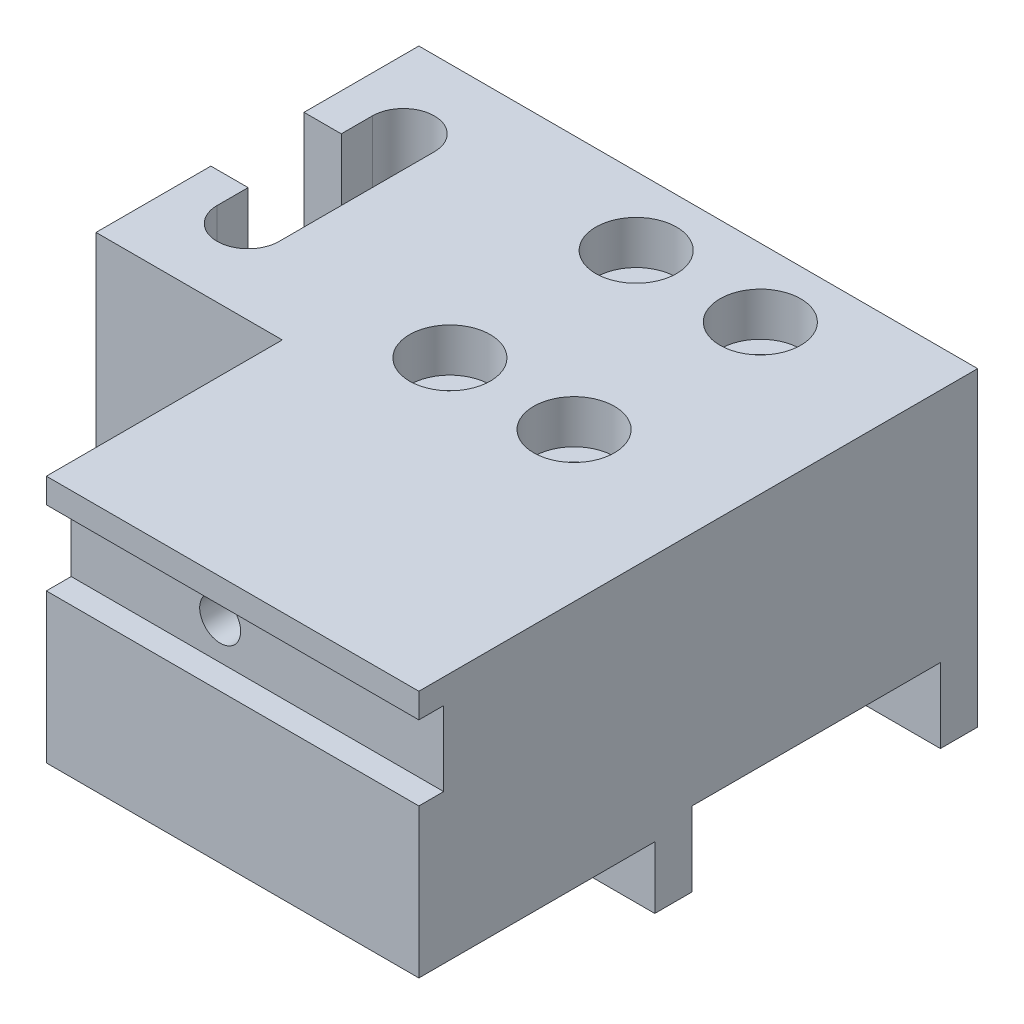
ISO-10303-21;
HEADER;
FILE_DESCRIPTION(('STEP AP214'),'2;1');
FILE_NAME('part.step','',(''),(''),'','','');
FILE_SCHEMA(('AUTOMOTIVE_DESIGN { 1 0 10303 214 1 1 1 1 }'));
ENDSEC;
DATA;
#1=APPLICATION_CONTEXT('core data for automotive mechanical design processes');
#2=APPLICATION_PROTOCOL_DEFINITION('international standard','automotive_design',2000,#1);
#3=PRODUCT_CONTEXT('',#1,'mechanical');
#4=PRODUCT('Part','Part','',(#3));
#5=PRODUCT_RELATED_PRODUCT_CATEGORY('part','',(#4));
#6=PRODUCT_DEFINITION_FORMATION('','',#4);
#7=PRODUCT_DEFINITION_CONTEXT('part definition',#1,'design');
#8=PRODUCT_DEFINITION('design','',#6,#7);
#9=PRODUCT_DEFINITION_SHAPE('','',#8);
#10=(LENGTH_UNIT() NAMED_UNIT(*) SI_UNIT(.MILLI.,.METRE.));
#11=(NAMED_UNIT(*) PLANE_ANGLE_UNIT() SI_UNIT($,.RADIAN.));
#12=(NAMED_UNIT(*) SI_UNIT($,.STERADIAN.) SOLID_ANGLE_UNIT());
#13=UNCERTAINTY_MEASURE_WITH_UNIT(LENGTH_MEASURE(1.E-05),#10,'distance_accuracy_value','');
#14=(GEOMETRIC_REPRESENTATION_CONTEXT(3) GLOBAL_UNCERTAINTY_ASSIGNED_CONTEXT((#13)) GLOBAL_UNIT_ASSIGNED_CONTEXT((#10,
#11,#12)) REPRESENTATION_CONTEXT('',''));
#15=CARTESIAN_POINT('',(0.,0.,0.));
#16=DIRECTION('',(0.,0.,1.));
#17=DIRECTION('',(1.,0.,0.));
#18=AXIS2_PLACEMENT_3D('',#15,#16,#17);
#19=CARTESIAN_POINT('',(23.,0.,20.5));
#20=DIRECTION('',(0.,1.,0.));
#21=DIRECTION('',(0.,0.,1.));
#22=AXIS2_PLACEMENT_3D('',#19,#20,#21);
#23=CYLINDRICAL_SURFACE('',#22,1.75);
#24=CARTESIAN_POINT('',(23.,6.00000000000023,20.5));
#25=DIRECTION('',(0.,1.,0.));
#26=DIRECTION('',(0.,0.,1.));
#27=AXIS2_PLACEMENT_3D('',#24,#25,#26);
#28=CIRCLE('',#27,1.75);
#29=CARTESIAN_POINT('',(23.,6.00000000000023,22.25));
#30=VERTEX_POINT('',#29);
#31=EDGE_CURVE('E260',#30,#30,#28,.T.);
#32=ORIENTED_EDGE('',*,*,#31,.F.);
#33=EDGE_LOOP('',(#32));
#34=FACE_BOUND('',#33,.T.);
#35=CARTESIAN_POINT('',(23.,21.5000000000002,20.5));
#36=DIRECTION('',(0.,1.,0.));
#37=DIRECTION('',(0.,0.,1.));
#38=AXIS2_PLACEMENT_3D('',#35,#36,#37);
#39=CIRCLE('',#38,1.75);
#40=CARTESIAN_POINT('',(23.,21.5000000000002,22.25));
#41=VERTEX_POINT('',#40);
#42=EDGE_CURVE('E38',#41,#41,#39,.F.);
#43=ORIENTED_EDGE('',*,*,#42,.F.);
#44=EDGE_LOOP('',(#43));
#45=FACE_BOUND('',#44,.T.);
#46=ADVANCED_FACE('F34',(#34,#45),#23,.F.);
#47=CARTESIAN_POINT('',(33.,0.,20.5));
#48=DIRECTION('',(0.,1.,0.));
#49=DIRECTION('',(0.,0.,1.));
#50=AXIS2_PLACEMENT_3D('',#47,#48,#49);
#51=CYLINDRICAL_SURFACE('',#50,1.75);
#52=CARTESIAN_POINT('',(33.,6.00000000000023,20.5));
#53=DIRECTION('',(0.,1.,0.));
#54=DIRECTION('',(0.,0.,1.));
#55=AXIS2_PLACEMENT_3D('',#52,#53,#54);
#56=CIRCLE('',#55,1.75);
#57=CARTESIAN_POINT('',(33.,6.00000000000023,22.25));
#58=VERTEX_POINT('',#57);
#59=EDGE_CURVE('E257',#58,#58,#56,.T.);
#60=ORIENTED_EDGE('',*,*,#59,.F.);
#61=EDGE_LOOP('',(#60));
#62=FACE_BOUND('',#61,.T.);
#63=CARTESIAN_POINT('',(33.,21.5000000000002,20.5));
#64=DIRECTION('',(0.,1.,0.));
#65=DIRECTION('',(0.,0.,1.));
#66=AXIS2_PLACEMENT_3D('',#63,#64,#65);
#67=CIRCLE('',#66,1.75);
#68=CARTESIAN_POINT('',(33.,21.5000000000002,22.25));
#69=VERTEX_POINT('',#68);
#70=EDGE_CURVE('E283',#69,#69,#67,.F.);
#71=ORIENTED_EDGE('',*,*,#70,.F.);
#72=EDGE_LOOP('',(#71));
#73=FACE_BOUND('',#72,.T.);
#74=ADVANCED_FACE('F547',(#62,#73),#51,.F.);
#75=CARTESIAN_POINT('',(33.,0.,5.5));
#76=DIRECTION('',(0.,1.,0.));
#77=DIRECTION('',(0.,0.,1.));
#78=AXIS2_PLACEMENT_3D('',#75,#76,#77);
#79=CYLINDRICAL_SURFACE('',#78,1.75);
#80=CARTESIAN_POINT('',(33.,6.00000000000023,5.5));
#81=DIRECTION('',(0.,1.,0.));
#82=DIRECTION('',(0.,0.,1.));
#83=AXIS2_PLACEMENT_3D('',#80,#81,#82);
#84=CIRCLE('',#83,1.75);
#85=CARTESIAN_POINT('',(33.,6.00000000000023,7.25));
#86=VERTEX_POINT('',#85);
#87=EDGE_CURVE('E254',#86,#86,#84,.T.);
#88=ORIENTED_EDGE('',*,*,#87,.F.);
#89=EDGE_LOOP('',(#88));
#90=FACE_BOUND('',#89,.T.);
#91=CARTESIAN_POINT('',(33.,21.5000000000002,5.5));
#92=DIRECTION('',(0.,1.,0.));
#93=DIRECTION('',(0.,0.,1.));
#94=AXIS2_PLACEMENT_3D('',#91,#92,#93);
#95=CIRCLE('',#94,1.75);
#96=CARTESIAN_POINT('',(33.,21.5000000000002,7.25));
#97=VERTEX_POINT('',#96);
#98=EDGE_CURVE('E279',#97,#97,#95,.F.);
#99=ORIENTED_EDGE('',*,*,#98,.F.);
#100=EDGE_LOOP('',(#99));
#101=FACE_BOUND('',#100,.T.);
#102=ADVANCED_FACE('F553',(#90,#101),#79,.F.);
#103=CARTESIAN_POINT('',(23.,0.,5.5));
#104=DIRECTION('',(0.,1.,0.));
#105=DIRECTION('',(0.,0.,1.));
#106=AXIS2_PLACEMENT_3D('',#103,#104,#105);
#107=CYLINDRICAL_SURFACE('',#106,1.75);
#108=CARTESIAN_POINT('',(23.,6.00000000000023,5.5));
#109=DIRECTION('',(0.,1.,0.));
#110=DIRECTION('',(0.,0.,1.));
#111=AXIS2_PLACEMENT_3D('',#108,#109,#110);
#112=CIRCLE('',#111,1.75);
#113=CARTESIAN_POINT('',(23.,6.00000000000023,7.25));
#114=VERTEX_POINT('',#113);
#115=EDGE_CURVE('E250',#114,#114,#112,.T.);
#116=ORIENTED_EDGE('',*,*,#115,.F.);
#117=EDGE_LOOP('',(#116));
#118=FACE_BOUND('',#117,.T.);
#119=CARTESIAN_POINT('',(23.,21.5000000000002,5.5));
#120=DIRECTION('',(0.,1.,0.));
#121=DIRECTION('',(0.,0.,1.));
#122=AXIS2_PLACEMENT_3D('',#119,#120,#121);
#123=CIRCLE('',#122,1.75);
#124=CARTESIAN_POINT('',(23.,21.5000000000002,7.25));
#125=VERTEX_POINT('',#124);
#126=EDGE_CURVE('E209',#125,#125,#123,.F.);
#127=ORIENTED_EDGE('',*,*,#126,.F.);
#128=EDGE_LOOP('',(#127));
#129=FACE_BOUND('',#128,.T.);
#130=ADVANCED_FACE('F563',(#118,#129),#107,.F.);
#131=CARTESIAN_POINT('',(0.,6.00000000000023,45.));
#132=DIRECTION('',(1.,0.,0.));
#133=DIRECTION('',(0.,0.,-1.));
#134=AXIS2_PLACEMENT_3D('',#131,#132,#133);
#135=PLANE('',#134);
#136=DIRECTION('',(0.,1.,0.));
#137=VECTOR('',#136,1.);
#138=CARTESIAN_POINT('',(0.,0.,26.));
#139=LINE('',#138,#137);
#140=CARTESIAN_POINT('',(0.,6.00000000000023,26.));
#141=VERTEX_POINT('',#140);
#142=CARTESIAN_POINT('',(0.,25.0000000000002,26.));
#143=VERTEX_POINT('',#142);
#144=EDGE_CURVE('E333',#141,#143,#139,.T.);
#145=ORIENTED_EDGE('',*,*,#144,.T.);
#146=DIRECTION('',(0.,0.,-1.));
#147=VECTOR('',#146,1.);
#148=CARTESIAN_POINT('',(0.,25.0000000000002,45.));
#149=LINE('',#148,#147);
#150=CARTESIAN_POINT('',(0.,25.0000000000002,16.75));
#151=VERTEX_POINT('',#150);
#152=EDGE_CURVE('E226',#143,#151,#149,.T.);
#153=ORIENTED_EDGE('',*,*,#152,.T.);
#154=DIRECTION('',(0.,1.,0.));
#155=VECTOR('',#154,1.);
#156=CARTESIAN_POINT('',(0.,0.,16.75));
#157=LINE('',#156,#155);
#158=CARTESIAN_POINT('',(0.,6.00000000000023,16.75));
#159=VERTEX_POINT('',#158);
#160=EDGE_CURVE('E336',#159,#151,#157,.T.);
#161=ORIENTED_EDGE('',*,*,#160,.F.);
#162=DIRECTION('',(0.,0.,-1.));
#163=VECTOR('',#162,1.);
#164=CARTESIAN_POINT('',(0.,6.00000000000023,45.));
#165=LINE('',#164,#163);
#166=EDGE_CURVE('E227',#141,#159,#165,.T.);
#167=ORIENTED_EDGE('',*,*,#166,.F.);
#168=EDGE_LOOP('',(#145,#153,#161,#167));
#169=FACE_BOUND('',#168,.T.);
#170=ADVANCED_FACE('F493',(#169),#135,.F.);
#171=DIRECTION('',(0.,1.,0.));
#172=VECTOR('',#171,1.);
#173=CARTESIAN_POINT('',(0.,0.,9.25));
#174=LINE('',#173,#172);
#175=CARTESIAN_POINT('',(0.,6.00000000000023,9.25000000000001));
#176=VERTEX_POINT('',#175);
#177=CARTESIAN_POINT('',(0.,25.0000000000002,9.25));
#178=VERTEX_POINT('',#177);
#179=EDGE_CURVE('E51',#176,#178,#174,.T.);
#180=ORIENTED_EDGE('',*,*,#179,.T.);
#181=CARTESIAN_POINT('',(0.,25.0000000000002,0.));
#182=VERTEX_POINT('',#181);
#183=EDGE_CURVE('E215',#178,#182,#149,.T.);
#184=ORIENTED_EDGE('',*,*,#183,.T.);
#185=DIRECTION('',(0.,-1.,0.));
#186=VECTOR('',#185,1.);
#187=CARTESIAN_POINT('',(0.,6.00000000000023,0.));
#188=LINE('',#187,#186);
#189=CARTESIAN_POINT('',(0.,6.00000000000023,0.));
#190=VERTEX_POINT('',#189);
#191=EDGE_CURVE('E422',#182,#190,#188,.T.);
#192=ORIENTED_EDGE('',*,*,#191,.T.);
#193=EDGE_CURVE('E217',#176,#190,#165,.T.);
#194=ORIENTED_EDGE('',*,*,#193,.F.);
#195=EDGE_LOOP('',(#180,#184,#192,#194));
#196=FACE_BOUND('',#195,.T.);
#197=ADVANCED_FACE('F213',(#196),#135,.F.);
#198=CARTESIAN_POINT('',(45.,2.27373675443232E-13,45.));
#199=DIRECTION('',(0.,0.,1.));
#200=DIRECTION('',(1.,0.,0.));
#201=AXIS2_PLACEMENT_3D('',#198,#199,#200);
#202=PLANE('',#201);
#203=DIRECTION('',(1.,0.,0.));
#204=VECTOR('',#203,1.);
#205=CARTESIAN_POINT('',(0.,17.,45.));
#206=LINE('',#205,#204);
#207=CARTESIAN_POINT('',(15.,17.,45.));
#208=VERTEX_POINT('',#207);
#209=CARTESIAN_POINT('',(45.,17.,45.));
#210=VERTEX_POINT('',#209);
#211=EDGE_CURVE('E397',#208,#210,#206,.T.);
#212=ORIENTED_EDGE('',*,*,#211,.F.);
#213=DIRECTION('',(0.,-1.,0.));
#214=VECTOR('',#213,1.);
#215=CARTESIAN_POINT('',(15.,2.27373675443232E-13,45.));
#216=LINE('',#215,#214);
#217=CARTESIAN_POINT('',(15.,5.,45.));
#218=VERTEX_POINT('',#217);
#219=EDGE_CURVE('E413',#208,#218,#216,.T.);
#220=ORIENTED_EDGE('',*,*,#219,.T.);
#221=DIRECTION('',(1.,0.,0.));
#222=VECTOR('',#221,1.);
#223=CARTESIAN_POINT('',(45.,5.,45.));
#224=LINE('',#223,#222);
#225=CARTESIAN_POINT('',(45.,5.,45.));
#226=VERTEX_POINT('',#225);
#227=EDGE_CURVE('E239',#218,#226,#224,.T.);
#228=ORIENTED_EDGE('',*,*,#227,.T.);
#229=DIRECTION('',(0.,1.,0.));
#230=VECTOR('',#229,1.);
#231=CARTESIAN_POINT('',(45.,2.27373675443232E-13,45.));
#232=LINE('',#231,#230);
#233=EDGE_CURVE('E408',#226,#210,#232,.T.);
#234=ORIENTED_EDGE('',*,*,#233,.T.);
#235=EDGE_LOOP('',(#212,#220,#228,#234));
#236=FACE_BOUND('',#235,.T.);
#237=ADVANCED_FACE('F467',(#236),#202,.T.);
#238=DIRECTION('',(-1.,0.,0.));
#239=VECTOR('',#238,1.);
#240=CARTESIAN_POINT('',(0.,25.0000000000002,45.));
#241=LINE('',#240,#239);
#242=CARTESIAN_POINT('',(45.,25.0000000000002,45.));
#243=VERTEX_POINT('',#242);
#244=CARTESIAN_POINT('',(15.,25.0000000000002,45.));
#245=VERTEX_POINT('',#244);
#246=EDGE_CURVE('E410',#243,#245,#241,.T.);
#247=ORIENTED_EDGE('',*,*,#246,.T.);
#248=DIRECTION('',(0.,1.,0.));
#249=VECTOR('',#248,1.);
#250=CARTESIAN_POINT('',(15.,0.,45.));
#251=LINE('',#250,#249);
#252=CARTESIAN_POINT('',(15.,23.,45.));
#253=VERTEX_POINT('',#252);
#254=EDGE_CURVE('E328',#253,#245,#251,.T.);
#255=ORIENTED_EDGE('',*,*,#254,.F.);
#256=DIRECTION('',(1.,0.,0.));
#257=VECTOR('',#256,1.);
#258=CARTESIAN_POINT('',(0.,23.,45.));
#259=LINE('',#258,#257);
#260=CARTESIAN_POINT('',(45.,23.,45.));
#261=VERTEX_POINT('',#260);
#262=EDGE_CURVE('E382',#253,#261,#259,.T.);
#263=ORIENTED_EDGE('',*,*,#262,.T.);
#264=EDGE_CURVE('E406',#261,#243,#232,.T.);
#265=ORIENTED_EDGE('',*,*,#264,.T.);
#266=EDGE_LOOP('',(#247,#255,#263,#265));
#267=FACE_BOUND('',#266,.T.);
#268=ADVANCED_FACE('F484',(#267),#202,.T.);
#269=CARTESIAN_POINT('',(0.,25.0000000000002,45.));
#270=DIRECTION('',(0.,-1.,0.));
#271=DIRECTION('',(0.,0.,-1.));
#272=AXIS2_PLACEMENT_3D('',#269,#270,#271);
#273=PLANE('',#272);
#274=CARTESIAN_POINT('',(23.,25.0000000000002,20.5));
#275=DIRECTION('',(0.,1.,0.));
#276=DIRECTION('',(0.,0.,1.));
#277=AXIS2_PLACEMENT_3D('',#274,#275,#276);
#278=CIRCLE('',#277,3.25);
#279=CARTESIAN_POINT('',(23.,25.0000000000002,23.75));
#280=VERTEX_POINT('',#279);
#281=EDGE_CURVE('E299',#280,#280,#278,.T.);
#282=ORIENTED_EDGE('',*,*,#281,.F.);
#283=EDGE_LOOP('',(#282));
#284=FACE_BOUND('',#283,.T.);
#285=CARTESIAN_POINT('',(33.,25.0000000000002,20.5));
#286=DIRECTION('',(0.,1.,0.));
#287=DIRECTION('',(0.,0.,1.));
#288=AXIS2_PLACEMENT_3D('',#285,#286,#287);
#289=CIRCLE('',#288,3.25);
#290=CARTESIAN_POINT('',(33.,25.0000000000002,23.75));
#291=VERTEX_POINT('',#290);
#292=EDGE_CURVE('E292',#291,#291,#289,.T.);
#293=ORIENTED_EDGE('',*,*,#292,.F.);
#294=EDGE_LOOP('',(#293));
#295=FACE_BOUND('',#294,.T.);
#296=CARTESIAN_POINT('',(33.,25.0000000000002,5.5));
#297=DIRECTION('',(0.,1.,0.));
#298=DIRECTION('',(0.,0.,1.));
#299=AXIS2_PLACEMENT_3D('',#296,#297,#298);
#300=CIRCLE('',#299,3.25);
#301=CARTESIAN_POINT('',(33.,25.0000000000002,8.75));
#302=VERTEX_POINT('',#301);
#303=EDGE_CURVE('E285',#302,#302,#300,.T.);
#304=ORIENTED_EDGE('',*,*,#303,.F.);
#305=EDGE_LOOP('',(#304));
#306=FACE_BOUND('',#305,.T.);
#307=CARTESIAN_POINT('',(23.,25.0000000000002,5.5));
#308=DIRECTION('',(0.,1.,0.));
#309=DIRECTION('',(0.,0.,1.));
#310=AXIS2_PLACEMENT_3D('',#307,#308,#309);
#311=CIRCLE('',#310,3.25);
#312=CARTESIAN_POINT('',(23.,25.0000000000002,8.75));
#313=VERTEX_POINT('',#312);
#314=EDGE_CURVE('E281',#313,#313,#311,.T.);
#315=ORIENTED_EDGE('',*,*,#314,.F.);
#316=EDGE_LOOP('',(#315));
#317=FACE_BOUND('',#316,.T.);
#318=DIRECTION('',(0.,0.,1.));
#319=VECTOR('',#318,1.);
#320=CARTESIAN_POINT('',(15.,25.0000000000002,45.));
#321=LINE('',#320,#319);
#322=CARTESIAN_POINT('',(15.,25.0000000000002,26.));
#323=VERTEX_POINT('',#322);
#324=EDGE_CURVE('E218',#323,#245,#321,.T.);
#325=ORIENTED_EDGE('',*,*,#324,.T.);
#326=ORIENTED_EDGE('',*,*,#246,.F.);
#327=DIRECTION('',(0.,0.,-1.));
#328=VECTOR('',#327,1.);
#329=CARTESIAN_POINT('',(45.,25.0000000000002,45.));
#330=LINE('',#329,#328);
#331=CARTESIAN_POINT('',(45.,25.0000000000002,0.));
#332=VERTEX_POINT('',#331);
#333=EDGE_CURVE('E230',#243,#332,#330,.T.);
#334=ORIENTED_EDGE('',*,*,#333,.T.);
#335=DIRECTION('',(-1.,0.,0.));
#336=VECTOR('',#335,1.);
#337=CARTESIAN_POINT('',(0.,25.0000000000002,0.));
#338=LINE('',#337,#336);
#339=EDGE_CURVE('E224',#332,#182,#338,.T.);
#340=ORIENTED_EDGE('',*,*,#339,.T.);
#341=ORIENTED_EDGE('',*,*,#183,.F.);
#342=DIRECTION('',(1.,0.,0.));
#343=VECTOR('',#342,1.);
#344=CARTESIAN_POINT('',(0.,25.0000000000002,9.25));
#345=LINE('',#344,#343);
#346=CARTESIAN_POINT('',(3.,25.0000000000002,9.25));
#347=VERTEX_POINT('',#346);
#348=EDGE_CURVE('E200',#178,#347,#345,.T.);
#349=ORIENTED_EDGE('',*,*,#348,.T.);
#350=DIRECTION('',(0.,0.,-1.));
#351=VECTOR('',#350,1.);
#352=CARTESIAN_POINT('',(3.,25.0000000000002,9.25));
#353=LINE('',#352,#351);
#354=CARTESIAN_POINT('',(3.,25.0000000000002,6.75));
#355=VERTEX_POINT('',#354);
#356=EDGE_CURVE('E208',#347,#355,#353,.T.);
#357=ORIENTED_EDGE('',*,*,#356,.T.);
#358=CARTESIAN_POINT('',(5.5,25.0000000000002,6.75));
#359=DIRECTION('',(0.,-1.,0.));
#360=DIRECTION('',(0.,0.,1.));
#361=AXIS2_PLACEMENT_3D('',#358,#359,#360);
#362=CIRCLE('',#361,2.5);
#363=CARTESIAN_POINT('',(8.,25.0000000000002,6.75));
#364=VERTEX_POINT('',#363);
#365=EDGE_CURVE('E309',#355,#364,#362,.T.);
#366=ORIENTED_EDGE('',*,*,#365,.T.);
#367=DIRECTION('',(0.,0.,1.));
#368=VECTOR('',#367,1.);
#369=CARTESIAN_POINT('',(8.,25.0000000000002,19.25));
#370=LINE('',#369,#368);
#371=CARTESIAN_POINT('',(8.,25.0000000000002,19.25));
#372=VERTEX_POINT('',#371);
#373=EDGE_CURVE('E312',#364,#372,#370,.T.);
#374=ORIENTED_EDGE('',*,*,#373,.T.);
#375=CARTESIAN_POINT('',(5.5,25.0000000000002,19.25));
#376=DIRECTION('',(0.,-1.,0.));
#377=DIRECTION('',(0.,0.,1.));
#378=AXIS2_PLACEMENT_3D('',#375,#376,#377);
#379=CIRCLE('',#378,2.5);
#380=CARTESIAN_POINT('',(3.,25.0000000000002,19.25));
#381=VERTEX_POINT('',#380);
#382=EDGE_CURVE('E315',#372,#381,#379,.T.);
#383=ORIENTED_EDGE('',*,*,#382,.T.);
#384=DIRECTION('',(0.,0.,-1.));
#385=VECTOR('',#384,1.);
#386=CARTESIAN_POINT('',(3.,25.0000000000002,19.25));
#387=LINE('',#386,#385);
#388=CARTESIAN_POINT('',(3.,25.0000000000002,16.75));
#389=VERTEX_POINT('',#388);
#390=EDGE_CURVE('E318',#381,#389,#387,.T.);
#391=ORIENTED_EDGE('',*,*,#390,.T.);
#392=DIRECTION('',(-1.,0.,0.));
#393=VECTOR('',#392,1.);
#394=CARTESIAN_POINT('',(0.,25.0000000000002,16.75));
#395=LINE('',#394,#393);
#396=EDGE_CURVE('E321',#389,#151,#395,.T.);
#397=ORIENTED_EDGE('',*,*,#396,.T.);
#398=ORIENTED_EDGE('',*,*,#152,.F.);
#399=DIRECTION('',(1.,0.,0.));
#400=VECTOR('',#399,1.);
#401=CARTESIAN_POINT('',(0.,25.0000000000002,26.));
#402=LINE('',#401,#400);
#403=EDGE_CURVE('E324',#143,#323,#402,.T.);
#404=ORIENTED_EDGE('',*,*,#403,.T.);
#405=EDGE_LOOP('',(#325,#326,#334,#340,#341,#349,#357,#366,#374,#383,#391,#397,#398,#404));
#406=FACE_BOUND('',#405,.T.);
#407=ADVANCED_FACE('F221',(#284,#295,#306,#317,#406),#273,.F.);
#408=CARTESIAN_POINT('',(15.,6.00000000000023,45.));
#409=DIRECTION('',(0.,1.,0.));
#410=DIRECTION('',(0.,0.,1.));
#411=AXIS2_PLACEMENT_3D('',#408,#409,#410);
#412=PLANE('',#411);
#413=ORIENTED_EDGE('',*,*,#31,.T.);
#414=EDGE_LOOP('',(#413));
#415=FACE_BOUND('',#414,.T.);
#416=ORIENTED_EDGE('',*,*,#59,.T.);
#417=EDGE_LOOP('',(#416));
#418=FACE_BOUND('',#417,.T.);
#419=ORIENTED_EDGE('',*,*,#87,.T.);
#420=EDGE_LOOP('',(#419));
#421=FACE_BOUND('',#420,.T.);
#422=ORIENTED_EDGE('',*,*,#115,.T.);
#423=EDGE_LOOP('',(#422));
#424=FACE_BOUND('',#423,.T.);
#425=DIRECTION('',(1.,0.,0.));
#426=VECTOR('',#425,1.);
#427=CARTESIAN_POINT('',(15.,6.00000000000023,26.));
#428=LINE('',#427,#426);
#429=CARTESIAN_POINT('',(15.,6.00000000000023,26.));
#430=VERTEX_POINT('',#429);
#431=EDGE_CURVE('E12',#141,#430,#428,.T.);
#432=ORIENTED_EDGE('',*,*,#431,.F.);
#433=ORIENTED_EDGE('',*,*,#166,.T.);
#434=DIRECTION('',(-1.,0.,0.));
#435=VECTOR('',#434,1.);
#436=CARTESIAN_POINT('',(15.,6.00000000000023,16.75));
#437=LINE('',#436,#435);
#438=CARTESIAN_POINT('',(3.,6.00000000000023,16.75));
#439=VERTEX_POINT('',#438);
#440=EDGE_CURVE('E43',#439,#159,#437,.T.);
#441=ORIENTED_EDGE('',*,*,#440,.F.);
#442=DIRECTION('',(0.,0.,-1.));
#443=VECTOR('',#442,1.);
#444=CARTESIAN_POINT('',(3.,6.00000000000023,45.));
#445=LINE('',#444,#443);
#446=CARTESIAN_POINT('',(3.,6.00000000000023,19.25));
#447=VERTEX_POINT('',#446);
#448=EDGE_CURVE('E273',#447,#439,#445,.T.);
#449=ORIENTED_EDGE('',*,*,#448,.F.);
#450=CARTESIAN_POINT('',(5.5,6.00000000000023,19.25));
#451=DIRECTION('',(0.,1.,0.));
#452=DIRECTION('',(0.,0.,1.));
#453=AXIS2_PLACEMENT_3D('',#450,#451,#452);
#454=CIRCLE('',#453,2.5);
#455=CARTESIAN_POINT('',(8.,6.00000000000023,19.25));
#456=VERTEX_POINT('',#455);
#457=EDGE_CURVE('E271',#456,#447,#454,.F.);
#458=ORIENTED_EDGE('',*,*,#457,.F.);
#459=DIRECTION('',(0.,0.,1.));
#460=VECTOR('',#459,1.);
#461=CARTESIAN_POINT('',(8.,6.00000000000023,45.));
#462=LINE('',#461,#460);
#463=CARTESIAN_POINT('',(8.,6.00000000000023,6.75));
#464=VERTEX_POINT('',#463);
#465=EDGE_CURVE('E269',#464,#456,#462,.T.);
#466=ORIENTED_EDGE('',*,*,#465,.F.);
#467=CARTESIAN_POINT('',(5.5,6.00000000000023,6.75));
#468=DIRECTION('',(0.,1.,0.));
#469=DIRECTION('',(0.,0.,1.));
#470=AXIS2_PLACEMENT_3D('',#467,#468,#469);
#471=CIRCLE('',#470,2.5);
#472=CARTESIAN_POINT('',(3.,6.00000000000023,6.75));
#473=VERTEX_POINT('',#472);
#474=EDGE_CURVE('E267',#473,#464,#471,.F.);
#475=ORIENTED_EDGE('',*,*,#474,.F.);
#476=DIRECTION('',(0.,0.,-1.));
#477=VECTOR('',#476,1.);
#478=CARTESIAN_POINT('',(3.,6.00000000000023,45.));
#479=LINE('',#478,#477);
#480=CARTESIAN_POINT('',(3.,6.00000000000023,9.25));
#481=VERTEX_POINT('',#480);
#482=EDGE_CURVE('E265',#481,#473,#479,.T.);
#483=ORIENTED_EDGE('',*,*,#482,.F.);
#484=DIRECTION('',(1.,0.,0.));
#485=VECTOR('',#484,1.);
#486=CARTESIAN_POINT('',(15.,6.00000000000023,9.25));
#487=LINE('',#486,#485);
#488=EDGE_CURVE('E249',#176,#481,#487,.T.);
#489=ORIENTED_EDGE('',*,*,#488,.F.);
#490=ORIENTED_EDGE('',*,*,#193,.T.);
#491=DIRECTION('',(1.,0.,0.));
#492=VECTOR('',#491,1.);
#493=CARTESIAN_POINT('',(15.,6.00000000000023,0.));
#494=LINE('',#493,#492);
#495=CARTESIAN_POINT('',(15.,6.00000000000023,0.));
#496=VERTEX_POINT('',#495);
#497=EDGE_CURVE('E424',#190,#496,#494,.T.);
#498=ORIENTED_EDGE('',*,*,#497,.T.);
#499=DIRECTION('',(0.,0.,-1.));
#500=VECTOR('',#499,1.);
#501=CARTESIAN_POINT('',(15.,6.00000000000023,45.));
#502=LINE('',#501,#500);
#503=CARTESIAN_POINT('',(15.,6.,3.));
#504=VERTEX_POINT('',#503);
#505=EDGE_CURVE('E431',#504,#496,#502,.T.);
#506=ORIENTED_EDGE('',*,*,#505,.F.);
#507=DIRECTION('',(1.,0.,0.));
#508=VECTOR('',#507,1.);
#509=CARTESIAN_POINT('',(0.,6.,3.));
#510=LINE('',#509,#508);
#511=CARTESIAN_POINT('',(45.,6.,3.));
#512=VERTEX_POINT('',#511);
#513=EDGE_CURVE('E386',#504,#512,#510,.T.);
#514=ORIENTED_EDGE('',*,*,#513,.T.);
#515=DIRECTION('',(0.,0.,-1.));
#516=VECTOR('',#515,1.);
#517=CARTESIAN_POINT('',(45.,6.,23.));
#518=LINE('',#517,#516);
#519=CARTESIAN_POINT('',(45.,6.,23.));
#520=VERTEX_POINT('',#519);
#521=EDGE_CURVE('E376',#520,#512,#518,.T.);
#522=ORIENTED_EDGE('',*,*,#521,.F.);
#523=DIRECTION('',(1.,0.,0.));
#524=VECTOR('',#523,1.);
#525=CARTESIAN_POINT('',(0.,6.,23.));
#526=LINE('',#525,#524);
#527=CARTESIAN_POINT('',(15.,6.,23.));
#528=VERTEX_POINT('',#527);
#529=EDGE_CURVE('E388',#528,#520,#526,.T.);
#530=ORIENTED_EDGE('',*,*,#529,.F.);
#531=EDGE_CURVE('E430',#430,#528,#502,.T.);
#532=ORIENTED_EDGE('',*,*,#531,.F.);
#533=EDGE_LOOP('',(#432,#433,#441,#449,#458,#466,#475,#483,#489,#490,#498,#506,#514,#522,#530,#532));
#534=FACE_BOUND('',#533,.T.);
#535=ADVANCED_FACE('F454',(#415,#418,#421,#424,#534),#412,.F.);
#536=CARTESIAN_POINT('',(0.,23.,45.));
#537=DIRECTION('',(0.,-1.,0.));
#538=DIRECTION('',(0.,0.,-1.));
#539=AXIS2_PLACEMENT_3D('',#536,#537,#538);
#540=PLANE('',#539);
#541=ORIENTED_EDGE('',*,*,#262,.F.);
#542=DIRECTION('',(0.,0.,-1.));
#543=VECTOR('',#542,1.);
#544=CARTESIAN_POINT('',(15.,23.,45.));
#545=LINE('',#544,#543);
#546=CARTESIAN_POINT('',(15.,23.,43.));
#547=VERTEX_POINT('',#546);
#548=EDGE_CURVE('E263',#253,#547,#545,.T.);
#549=ORIENTED_EDGE('',*,*,#548,.T.);
#550=DIRECTION('',(1.,0.,0.));
#551=VECTOR('',#550,1.);
#552=CARTESIAN_POINT('',(0.,23.,43.));
#553=LINE('',#552,#551);
#554=CARTESIAN_POINT('',(45.,23.,43.));
#555=VERTEX_POINT('',#554);
#556=EDGE_CURVE('E401',#547,#555,#553,.T.);
#557=ORIENTED_EDGE('',*,*,#556,.T.);
#558=DIRECTION('',(0.,0.,-1.));
#559=VECTOR('',#558,1.);
#560=CARTESIAN_POINT('',(45.,23.,45.));
#561=LINE('',#560,#559);
#562=EDGE_CURVE('E356',#261,#555,#561,.T.);
#563=ORIENTED_EDGE('',*,*,#562,.F.);
#564=EDGE_LOOP('',(#541,#549,#557,#563));
#565=FACE_BOUND('',#564,.T.);
#566=ADVANCED_FACE('F482',(#565),#540,.T.);
#567=CARTESIAN_POINT('',(0.,17.,45.));
#568=DIRECTION('',(0.,1.,0.));
#569=DIRECTION('',(0.,0.,1.));
#570=AXIS2_PLACEMENT_3D('',#567,#568,#569);
#571=PLANE('',#570);
#572=DIRECTION('',(1.,0.,0.));
#573=VECTOR('',#572,1.);
#574=CARTESIAN_POINT('',(0.,17.,43.));
#575=LINE('',#574,#573);
#576=CARTESIAN_POINT('',(15.,17.,43.));
#577=VERTEX_POINT('',#576);
#578=CARTESIAN_POINT('',(45.,17.,43.));
#579=VERTEX_POINT('',#578);
#580=EDGE_CURVE('E399',#577,#579,#575,.T.);
#581=ORIENTED_EDGE('',*,*,#580,.F.);
#582=DIRECTION('',(0.,0.,1.));
#583=VECTOR('',#582,1.);
#584=CARTESIAN_POINT('',(15.,17.,45.));
#585=LINE('',#584,#583);
#586=EDGE_CURVE('E59',#577,#208,#585,.T.);
#587=ORIENTED_EDGE('',*,*,#586,.T.);
#588=ORIENTED_EDGE('',*,*,#211,.T.);
#589=DIRECTION('',(0.,0.,1.));
#590=VECTOR('',#589,1.);
#591=CARTESIAN_POINT('',(45.,17.,45.));
#592=LINE('',#591,#590);
#593=EDGE_CURVE('E364',#579,#210,#592,.T.);
#594=ORIENTED_EDGE('',*,*,#593,.F.);
#595=EDGE_LOOP('',(#581,#587,#588,#594));
#596=FACE_BOUND('',#595,.T.);
#597=ADVANCED_FACE('F472',(#596),#571,.T.);
#598=CARTESIAN_POINT('',(0.,17.,43.));
#599=DIRECTION('',(0.,0.,1.));
#600=DIRECTION('',(1.,0.,0.));
#601=AXIS2_PLACEMENT_3D('',#598,#599,#600);
#602=PLANE('',#601);
#603=CARTESIAN_POINT('',(27.,20.0000000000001,43.));
#604=DIRECTION('',(0.,0.,1.));
#605=DIRECTION('',(1.,0.,0.));
#606=AXIS2_PLACEMENT_3D('',#603,#604,#605);
#607=CIRCLE('',#606,1.64999999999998);
#608=CARTESIAN_POINT('',(28.65,20.0000000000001,43.));
#609=VERTEX_POINT('',#608);
#610=EDGE_CURVE('E253',#609,#609,#607,.T.);
#611=ORIENTED_EDGE('',*,*,#610,.F.);
#612=EDGE_LOOP('',(#611));
#613=FACE_BOUND('',#612,.T.);
#614=ORIENTED_EDGE('',*,*,#556,.F.);
#615=DIRECTION('',(0.,-1.,0.));
#616=VECTOR('',#615,1.);
#617=CARTESIAN_POINT('',(15.,17.,43.));
#618=LINE('',#617,#616);
#619=EDGE_CURVE('E330',#547,#577,#618,.T.);
#620=ORIENTED_EDGE('',*,*,#619,.T.);
#621=ORIENTED_EDGE('',*,*,#580,.T.);
#622=DIRECTION('',(0.,-1.,0.));
#623=VECTOR('',#622,1.);
#624=CARTESIAN_POINT('',(45.,17.,43.));
#625=LINE('',#624,#623);
#626=EDGE_CURVE('E361',#555,#579,#625,.T.);
#627=ORIENTED_EDGE('',*,*,#626,.F.);
#628=EDGE_LOOP('',(#614,#620,#621,#627));
#629=FACE_BOUND('',#628,.T.);
#630=ADVANCED_FACE('F478',(#613,#629),#602,.T.);
#631=CARTESIAN_POINT('',(15.,2.27373675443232E-13,45.));
#632=DIRECTION('',(0.,1.,0.));
#633=DIRECTION('',(0.,0.,1.));
#634=AXIS2_PLACEMENT_3D('',#631,#632,#633);
#635=PLANE('',#634);
#636=DIRECTION('',(1.,0.,0.));
#637=VECTOR('',#636,1.);
#638=CARTESIAN_POINT('',(0.,0.,3.));
#639=LINE('',#638,#637);
#640=CARTESIAN_POINT('',(15.,0.,3.));
#641=VERTEX_POINT('',#640);
#642=CARTESIAN_POINT('',(45.,0.,3.));
#643=VERTEX_POINT('',#642);
#644=EDGE_CURVE('E383',#641,#643,#639,.T.);
#645=ORIENTED_EDGE('',*,*,#644,.F.);
#646=DIRECTION('',(0.,0.,-1.));
#647=VECTOR('',#646,1.);
#648=CARTESIAN_POINT('',(15.,2.27373675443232E-13,45.));
#649=LINE('',#648,#647);
#650=CARTESIAN_POINT('',(15.,2.27373675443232E-13,0.));
#651=VERTEX_POINT('',#650);
#652=EDGE_CURVE('E416',#641,#651,#649,.T.);
#653=ORIENTED_EDGE('',*,*,#652,.T.);
#654=DIRECTION('',(1.,0.,0.));
#655=VECTOR('',#654,1.);
#656=CARTESIAN_POINT('',(15.,2.27373675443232E-13,0.));
#657=LINE('',#656,#655);
#658=CARTESIAN_POINT('',(45.,2.27373675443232E-13,0.));
#659=VERTEX_POINT('',#658);
#660=EDGE_CURVE('E405',#651,#659,#657,.T.);
#661=ORIENTED_EDGE('',*,*,#660,.T.);
#662=DIRECTION('',(0.,0.,-1.));
#663=VECTOR('',#662,1.);
#664=CARTESIAN_POINT('',(45.,2.27373675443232E-13,45.));
#665=LINE('',#664,#663);
#666=EDGE_CURVE('E236',#643,#659,#665,.T.);
#667=ORIENTED_EDGE('',*,*,#666,.F.);
#668=EDGE_LOOP('',(#645,#653,#661,#667));
#669=FACE_BOUND('',#668,.T.);
#670=ADVANCED_FACE('F36',(#669),#635,.F.);
#671=DIRECTION('',(1.,0.,0.));
#672=VECTOR('',#671,1.);
#673=CARTESIAN_POINT('',(0.,0.,23.));
#674=LINE('',#673,#672);
#675=CARTESIAN_POINT('',(15.,2.27373675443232E-13,23.));
#676=VERTEX_POINT('',#675);
#677=CARTESIAN_POINT('',(45.,0.,23.));
#678=VERTEX_POINT('',#677);
#679=EDGE_CURVE('E390',#676,#678,#674,.T.);
#680=ORIENTED_EDGE('',*,*,#679,.T.);
#681=CARTESIAN_POINT('',(45.,0.,26.));
#682=VERTEX_POINT('',#681);
#683=EDGE_CURVE('E238',#682,#678,#665,.T.);
#684=ORIENTED_EDGE('',*,*,#683,.F.);
#685=DIRECTION('',(1.,0.,0.));
#686=VECTOR('',#685,1.);
#687=CARTESIAN_POINT('',(0.,0.,26.));
#688=LINE('',#687,#686);
#689=CARTESIAN_POINT('',(15.,0.,26.));
#690=VERTEX_POINT('',#689);
#691=EDGE_CURVE('E393',#690,#682,#688,.T.);
#692=ORIENTED_EDGE('',*,*,#691,.F.);
#693=EDGE_CURVE('E429',#690,#676,#649,.T.);
#694=ORIENTED_EDGE('',*,*,#693,.T.);
#695=EDGE_LOOP('',(#680,#684,#692,#694));
#696=FACE_BOUND('',#695,.T.);
#697=ADVANCED_FACE('F442',(#696),#635,.F.);
#698=CARTESIAN_POINT('',(45.,2.27373675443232E-13,45.));
#699=DIRECTION('',(-1.,0.,0.));
#700=DIRECTION('',(0.,0.,1.));
#701=AXIS2_PLACEMENT_3D('',#698,#699,#700);
#702=PLANE('',#701);
#703=DIRECTION('',(0.,-1.,0.));
#704=VECTOR('',#703,1.);
#705=CARTESIAN_POINT('',(45.,0.,3.));
#706=LINE('',#705,#704);
#707=EDGE_CURVE('E379',#512,#643,#706,.T.);
#708=ORIENTED_EDGE('',*,*,#707,.T.);
#709=ORIENTED_EDGE('',*,*,#666,.T.);
#710=DIRECTION('',(0.,1.,0.));
#711=VECTOR('',#710,1.);
#712=CARTESIAN_POINT('',(45.,2.27373675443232E-13,0.));
#713=LINE('',#712,#711);
#714=EDGE_CURVE('E419',#659,#332,#713,.T.);
#715=ORIENTED_EDGE('',*,*,#714,.T.);
#716=ORIENTED_EDGE('',*,*,#333,.F.);
#717=ORIENTED_EDGE('',*,*,#264,.F.);
#718=ORIENTED_EDGE('',*,*,#562,.T.);
#719=ORIENTED_EDGE('',*,*,#626,.T.);
#720=ORIENTED_EDGE('',*,*,#593,.T.);
#721=ORIENTED_EDGE('',*,*,#233,.F.);
#722=DIRECTION('',(0.,0.,-1.));
#723=VECTOR('',#722,1.);
#724=CARTESIAN_POINT('',(45.,5.,45.));
#725=LINE('',#724,#723);
#726=CARTESIAN_POINT('',(45.,5.,26.));
#727=VERTEX_POINT('',#726);
#728=EDGE_CURVE('E367',#226,#727,#725,.T.);
#729=ORIENTED_EDGE('',*,*,#728,.T.);
#730=DIRECTION('',(0.,-1.,0.));
#731=VECTOR('',#730,1.);
#732=CARTESIAN_POINT('',(45.,5.,26.));
#733=LINE('',#732,#731);
#734=EDGE_CURVE('E370',#727,#682,#733,.T.);
#735=ORIENTED_EDGE('',*,*,#734,.T.);
#736=ORIENTED_EDGE('',*,*,#683,.T.);
#737=DIRECTION('',(0.,1.,0.));
#738=VECTOR('',#737,1.);
#739=CARTESIAN_POINT('',(45.,0.,23.));
#740=LINE('',#739,#738);
#741=EDGE_CURVE('E373',#678,#520,#740,.T.);
#742=ORIENTED_EDGE('',*,*,#741,.T.);
#743=ORIENTED_EDGE('',*,*,#521,.T.);
#744=EDGE_LOOP('',(#708,#709,#715,#716,#717,#718,#719,#720,#721,#729,#735,#736,#742,#743));
#745=FACE_BOUND('',#744,.T.);
#746=ADVANCED_FACE('F457',(#745),#702,.F.);
#747=CARTESIAN_POINT('',(15.,2.27373675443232E-13,45.));
#748=DIRECTION('',(1.,0.,0.));
#749=DIRECTION('',(0.,0.,-1.));
#750=AXIS2_PLACEMENT_3D('',#747,#748,#749);
#751=PLANE('',#750);
#752=DIRECTION('',(0.,-1.,0.));
#753=VECTOR('',#752,1.);
#754=CARTESIAN_POINT('',(15.,2.27373675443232E-13,3.00000000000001));
#755=LINE('',#754,#753);
#756=EDGE_CURVE('E247',#504,#641,#755,.T.);
#757=ORIENTED_EDGE('',*,*,#756,.F.);
#758=ORIENTED_EDGE('',*,*,#505,.T.);
#759=DIRECTION('',(0.,-1.,0.));
#760=VECTOR('',#759,1.);
#761=CARTESIAN_POINT('',(15.,2.27373675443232E-13,0.));
#762=LINE('',#761,#760);
#763=EDGE_CURVE('E409',#496,#651,#762,.T.);
#764=ORIENTED_EDGE('',*,*,#763,.T.);
#765=ORIENTED_EDGE('',*,*,#652,.F.);
#766=EDGE_LOOP('',(#757,#758,#764,#765));
#767=FACE_BOUND('',#766,.T.);
#768=ADVANCED_FACE('F530',(#767),#751,.F.);
#769=CARTESIAN_POINT('',(15.,11.0000000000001,40.));
#770=DIRECTION('',(-1.,0.,0.));
#771=DIRECTION('',(0.,0.,1.));
#772=AXIS2_PLACEMENT_3D('',#769,#770,#771);
#773=CIRCLE('',#772,1.64999999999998);
#774=CARTESIAN_POINT('',(15.,11.0000000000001,41.65));
#775=VERTEX_POINT('',#774);
#776=EDGE_CURVE('E928',#775,#775,#773,.T.);
#777=ORIENTED_EDGE('',*,*,#776,.F.);
#778=EDGE_LOOP('',(#777));
#779=FACE_BOUND('',#778,.T.);
#780=CARTESIAN_POINT('',(15.,11.0000000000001,31.));
#781=DIRECTION('',(-1.,0.,0.));
#782=DIRECTION('',(0.,0.,1.));
#783=AXIS2_PLACEMENT_3D('',#780,#781,#782);
#784=CIRCLE('',#783,1.64999999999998);
#785=CARTESIAN_POINT('',(15.,11.0000000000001,32.65));
#786=VERTEX_POINT('',#785);
#787=EDGE_CURVE('E927',#786,#786,#784,.T.);
#788=ORIENTED_EDGE('',*,*,#787,.F.);
#789=EDGE_LOOP('',(#788));
#790=FACE_BOUND('',#789,.T.);
#791=ORIENTED_EDGE('',*,*,#219,.F.);
#792=ORIENTED_EDGE('',*,*,#586,.F.);
#793=ORIENTED_EDGE('',*,*,#619,.F.);
#794=ORIENTED_EDGE('',*,*,#548,.F.);
#795=ORIENTED_EDGE('',*,*,#254,.T.);
#796=ORIENTED_EDGE('',*,*,#324,.F.);
#797=DIRECTION('',(0.,1.,0.));
#798=VECTOR('',#797,1.);
#799=CARTESIAN_POINT('',(15.,0.,26.));
#800=LINE('',#799,#798);
#801=EDGE_CURVE('E331',#430,#323,#800,.T.);
#802=ORIENTED_EDGE('',*,*,#801,.F.);
#803=ORIENTED_EDGE('',*,*,#531,.T.);
#804=DIRECTION('',(0.,1.,0.));
#805=VECTOR('',#804,1.);
#806=CARTESIAN_POINT('',(15.,2.27373675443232E-13,23.));
#807=LINE('',#806,#805);
#808=EDGE_CURVE('E244',#676,#528,#807,.T.);
#809=ORIENTED_EDGE('',*,*,#808,.F.);
#810=ORIENTED_EDGE('',*,*,#693,.F.);
#811=DIRECTION('',(0.,-1.,0.));
#812=VECTOR('',#811,1.);
#813=CARTESIAN_POINT('',(15.,2.27373675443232E-13,26.));
#814=LINE('',#813,#812);
#815=CARTESIAN_POINT('',(15.,5.,26.));
#816=VERTEX_POINT('',#815);
#817=EDGE_CURVE('E242',#816,#690,#814,.T.);
#818=ORIENTED_EDGE('',*,*,#817,.F.);
#819=DIRECTION('',(0.,0.,-1.));
#820=VECTOR('',#819,1.);
#821=CARTESIAN_POINT('',(15.,5.,45.));
#822=LINE('',#821,#820);
#823=EDGE_CURVE('E385',#218,#816,#822,.T.);
#824=ORIENTED_EDGE('',*,*,#823,.F.);
#825=EDGE_LOOP('',(#791,#792,#793,#794,#795,#796,#802,#803,#809,#810,#818,#824));
#826=FACE_BOUND('',#825,.T.);
#827=ADVANCED_FACE('F446',(#779,#790,#826),#751,.F.);
#828=CARTESIAN_POINT('',(45.,2.27373675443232E-13,0.));
#829=DIRECTION('',(0.,0.,1.));
#830=DIRECTION('',(1.,0.,0.));
#831=AXIS2_PLACEMENT_3D('',#828,#829,#830);
#832=PLANE('',#831);
#833=ORIENTED_EDGE('',*,*,#660,.F.);
#834=ORIENTED_EDGE('',*,*,#763,.F.);
#835=ORIENTED_EDGE('',*,*,#497,.F.);
#836=ORIENTED_EDGE('',*,*,#191,.F.);
#837=ORIENTED_EDGE('',*,*,#339,.F.);
#838=ORIENTED_EDGE('',*,*,#714,.F.);
#839=EDGE_LOOP('',(#833,#834,#835,#836,#837,#838));
#840=FACE_BOUND('',#839,.T.);
#841=ADVANCED_FACE('F527',(#840),#832,.F.);
#842=CARTESIAN_POINT('',(0.,5.,45.));
#843=DIRECTION('',(0.,-1.,0.));
#844=DIRECTION('',(0.,0.,-1.));
#845=AXIS2_PLACEMENT_3D('',#842,#843,#844);
#846=PLANE('',#845);
#847=ORIENTED_EDGE('',*,*,#823,.T.);
#848=DIRECTION('',(1.,0.,0.));
#849=VECTOR('',#848,1.);
#850=CARTESIAN_POINT('',(0.,5.,26.));
#851=LINE('',#850,#849);
#852=EDGE_CURVE('E395',#816,#727,#851,.T.);
#853=ORIENTED_EDGE('',*,*,#852,.T.);
#854=ORIENTED_EDGE('',*,*,#728,.F.);
#855=ORIENTED_EDGE('',*,*,#227,.F.);
#856=EDGE_LOOP('',(#847,#853,#854,#855));
#857=FACE_BOUND('',#856,.T.);
#858=ADVANCED_FACE('F464',(#857),#846,.T.);
#859=CARTESIAN_POINT('',(0.,5.,26.));
#860=DIRECTION('',(0.,0.,1.));
#861=DIRECTION('',(1.,0.,0.));
#862=AXIS2_PLACEMENT_3D('',#859,#860,#861);
#863=PLANE('',#862);
#864=ORIENTED_EDGE('',*,*,#817,.T.);
#865=ORIENTED_EDGE('',*,*,#691,.T.);
#866=ORIENTED_EDGE('',*,*,#734,.F.);
#867=ORIENTED_EDGE('',*,*,#852,.F.);
#868=EDGE_LOOP('',(#864,#865,#866,#867));
#869=FACE_BOUND('',#868,.T.);
#870=ADVANCED_FACE('F462',(#869),#863,.T.);
#871=CARTESIAN_POINT('',(0.,0.,3.));
#872=DIRECTION('',(0.,0.,1.));
#873=DIRECTION('',(1.,0.,0.));
#874=AXIS2_PLACEMENT_3D('',#871,#872,#873);
#875=PLANE('',#874);
#876=ORIENTED_EDGE('',*,*,#756,.T.);
#877=ORIENTED_EDGE('',*,*,#644,.T.);
#878=ORIENTED_EDGE('',*,*,#707,.F.);
#879=ORIENTED_EDGE('',*,*,#513,.F.);
#880=EDGE_LOOP('',(#876,#877,#878,#879));
#881=FACE_BOUND('',#880,.T.);
#882=ADVANCED_FACE('F535',(#881),#875,.T.);
#883=CARTESIAN_POINT('',(0.,0.,23.));
#884=DIRECTION('',(0.,0.,-1.));
#885=DIRECTION('',(-1.,0.,0.));
#886=AXIS2_PLACEMENT_3D('',#883,#884,#885);
#887=PLANE('',#886);
#888=ORIENTED_EDGE('',*,*,#808,.T.);
#889=ORIENTED_EDGE('',*,*,#529,.T.);
#890=ORIENTED_EDGE('',*,*,#741,.F.);
#891=ORIENTED_EDGE('',*,*,#679,.F.);
#892=EDGE_LOOP('',(#888,#889,#890,#891));
#893=FACE_BOUND('',#892,.T.);
#894=ADVANCED_FACE('F450',(#893),#887,.T.);
#895=CARTESIAN_POINT('',(27.,20.0000000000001,28.));
#896=DIRECTION('',(0.,0.,1.));
#897=DIRECTION('',(1.,0.,0.));
#898=AXIS2_PLACEMENT_3D('',#895,#896,#897);
#899=CYLINDRICAL_SURFACE('',#898,1.64999999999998);
#900=CARTESIAN_POINT('',(27.,20.0000000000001,28.));
#901=DIRECTION('',(0.,0.,1.));
#902=DIRECTION('',(1.,0.,0.));
#903=AXIS2_PLACEMENT_3D('',#900,#901,#902);
#904=CIRCLE('',#903,1.64999999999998);
#905=CARTESIAN_POINT('',(28.65,20.0000000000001,28.));
#906=VERTEX_POINT('',#905);
#907=EDGE_CURVE('E353',#906,#906,#904,.T.);
#908=ORIENTED_EDGE('',*,*,#907,.F.);
#909=EDGE_LOOP('',(#908));
#910=FACE_BOUND('',#909,.T.);
#911=ORIENTED_EDGE('',*,*,#610,.T.);
#912=EDGE_LOOP('',(#911));
#913=FACE_BOUND('',#912,.T.);
#914=ADVANCED_FACE('F542',(#910,#913),#899,.F.);
#915=CARTESIAN_POINT('',(27.,20.0000000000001,28.));
#916=DIRECTION('',(0.,0.,1.));
#917=DIRECTION('',(1.,0.,0.));
#918=AXIS2_PLACEMENT_3D('',#915,#916,#917);
#919=PLANE('',#918);
#920=ORIENTED_EDGE('',*,*,#907,.T.);
#921=EDGE_LOOP('',(#920));
#922=FACE_BOUND('',#921,.T.);
#923=ADVANCED_FACE('F568',(#922),#919,.T.);
#924=CARTESIAN_POINT('',(0.,0.,26.));
#925=DIRECTION('',(0.,0.,1.));
#926=DIRECTION('',(1.,0.,0.));
#927=AXIS2_PLACEMENT_3D('',#924,#925,#926);
#928=PLANE('',#927);
#929=ORIENTED_EDGE('',*,*,#431,.T.);
#930=ORIENTED_EDGE('',*,*,#801,.T.);
#931=ORIENTED_EDGE('',*,*,#403,.F.);
#932=ORIENTED_EDGE('',*,*,#144,.F.);
#933=EDGE_LOOP('',(#929,#930,#931,#932));
#934=FACE_BOUND('',#933,.T.);
#935=ADVANCED_FACE('F490',(#934),#928,.T.);
#936=CARTESIAN_POINT('',(0.,0.,16.75));
#937=DIRECTION('',(0.,0.,-1.));
#938=DIRECTION('',(-1.,0.,0.));
#939=AXIS2_PLACEMENT_3D('',#936,#937,#938);
#940=PLANE('',#939);
#941=ORIENTED_EDGE('',*,*,#440,.T.);
#942=ORIENTED_EDGE('',*,*,#160,.T.);
#943=ORIENTED_EDGE('',*,*,#396,.F.);
#944=DIRECTION('',(0.,1.,0.));
#945=VECTOR('',#944,1.);
#946=CARTESIAN_POINT('',(3.,0.,16.75));
#947=LINE('',#946,#945);
#948=EDGE_CURVE('E338',#439,#389,#947,.T.);
#949=ORIENTED_EDGE('',*,*,#948,.F.);
#950=EDGE_LOOP('',(#941,#942,#943,#949));
#951=FACE_BOUND('',#950,.T.);
#952=ADVANCED_FACE('F500',(#951),#940,.T.);
#953=CARTESIAN_POINT('',(3.,0.,19.25));
#954=DIRECTION('',(1.,0.,0.));
#955=DIRECTION('',(0.,0.,-1.));
#956=AXIS2_PLACEMENT_3D('',#953,#954,#955);
#957=PLANE('',#956);
#958=ORIENTED_EDGE('',*,*,#448,.T.);
#959=ORIENTED_EDGE('',*,*,#948,.T.);
#960=ORIENTED_EDGE('',*,*,#390,.F.);
#961=DIRECTION('',(0.,1.,0.));
#962=VECTOR('',#961,1.);
#963=CARTESIAN_POINT('',(3.,0.,19.25));
#964=LINE('',#963,#962);
#965=EDGE_CURVE('E340',#447,#381,#964,.T.);
#966=ORIENTED_EDGE('',*,*,#965,.F.);
#967=EDGE_LOOP('',(#958,#959,#960,#966));
#968=FACE_BOUND('',#967,.T.);
#969=ADVANCED_FACE('F504',(#968),#957,.T.);
#970=CARTESIAN_POINT('',(5.5,0.,19.25));
#971=DIRECTION('',(0.,1.,0.));
#972=DIRECTION('',(0.,0.,1.));
#973=AXIS2_PLACEMENT_3D('',#970,#971,#972);
#974=CYLINDRICAL_SURFACE('',#973,2.5);
#975=ORIENTED_EDGE('',*,*,#457,.T.);
#976=ORIENTED_EDGE('',*,*,#965,.T.);
#977=ORIENTED_EDGE('',*,*,#382,.F.);
#978=DIRECTION('',(0.,1.,0.));
#979=VECTOR('',#978,1.);
#980=CARTESIAN_POINT('',(8.,0.,19.25));
#981=LINE('',#980,#979);
#982=EDGE_CURVE('E342',#456,#372,#981,.T.);
#983=ORIENTED_EDGE('',*,*,#982,.F.);
#984=EDGE_LOOP('',(#975,#976,#977,#983));
#985=FACE_BOUND('',#984,.T.);
#986=ADVANCED_FACE('F508',(#985),#974,.F.);
#987=CARTESIAN_POINT('',(8.,0.,19.25));
#988=DIRECTION('',(-1.,0.,0.));
#989=DIRECTION('',(0.,0.,1.));
#990=AXIS2_PLACEMENT_3D('',#987,#988,#989);
#991=PLANE('',#990);
#992=ORIENTED_EDGE('',*,*,#465,.T.);
#993=ORIENTED_EDGE('',*,*,#982,.T.);
#994=ORIENTED_EDGE('',*,*,#373,.F.);
#995=DIRECTION('',(0.,1.,0.));
#996=VECTOR('',#995,1.);
#997=CARTESIAN_POINT('',(8.,0.,6.75));
#998=LINE('',#997,#996);
#999=EDGE_CURVE('E344',#464,#364,#998,.T.);
#1000=ORIENTED_EDGE('',*,*,#999,.F.);
#1001=EDGE_LOOP('',(#992,#993,#994,#1000));
#1002=FACE_BOUND('',#1001,.T.);
#1003=ADVANCED_FACE('F515',(#1002),#991,.T.);
#1004=CARTESIAN_POINT('',(5.5,0.,6.75));
#1005=DIRECTION('',(0.,1.,0.));
#1006=DIRECTION('',(0.,0.,1.));
#1007=AXIS2_PLACEMENT_3D('',#1004,#1005,#1006);
#1008=CYLINDRICAL_SURFACE('',#1007,2.5);
#1009=ORIENTED_EDGE('',*,*,#474,.T.);
#1010=ORIENTED_EDGE('',*,*,#999,.T.);
#1011=ORIENTED_EDGE('',*,*,#365,.F.);
#1012=DIRECTION('',(0.,1.,0.));
#1013=VECTOR('',#1012,1.);
#1014=CARTESIAN_POINT('',(3.,0.,6.75));
#1015=LINE('',#1014,#1013);
#1016=EDGE_CURVE('E346',#473,#355,#1015,.T.);
#1017=ORIENTED_EDGE('',*,*,#1016,.F.);
#1018=EDGE_LOOP('',(#1009,#1010,#1011,#1017));
#1019=FACE_BOUND('',#1018,.T.);
#1020=ADVANCED_FACE('F519',(#1019),#1008,.F.);
#1021=CARTESIAN_POINT('',(3.,0.,9.25));
#1022=DIRECTION('',(1.,0.,0.));
#1023=DIRECTION('',(0.,0.,-1.));
#1024=AXIS2_PLACEMENT_3D('',#1021,#1022,#1023);
#1025=PLANE('',#1024);
#1026=ORIENTED_EDGE('',*,*,#482,.T.);
#1027=ORIENTED_EDGE('',*,*,#1016,.T.);
#1028=ORIENTED_EDGE('',*,*,#356,.F.);
#1029=DIRECTION('',(0.,1.,0.));
#1030=VECTOR('',#1029,1.);
#1031=CARTESIAN_POINT('',(3.,0.,9.25));
#1032=LINE('',#1031,#1030);
#1033=EDGE_CURVE('E203',#481,#347,#1032,.T.);
#1034=ORIENTED_EDGE('',*,*,#1033,.F.);
#1035=EDGE_LOOP('',(#1026,#1027,#1028,#1034));
#1036=FACE_BOUND('',#1035,.T.);
#1037=ADVANCED_FACE('F522',(#1036),#1025,.T.);
#1038=CARTESIAN_POINT('',(0.,0.,9.25));
#1039=DIRECTION('',(0.,0.,1.));
#1040=DIRECTION('',(1.,0.,0.));
#1041=AXIS2_PLACEMENT_3D('',#1038,#1039,#1040);
#1042=PLANE('',#1041);
#1043=ORIENTED_EDGE('',*,*,#488,.T.);
#1044=ORIENTED_EDGE('',*,*,#1033,.T.);
#1045=ORIENTED_EDGE('',*,*,#348,.F.);
#1046=ORIENTED_EDGE('',*,*,#179,.F.);
#1047=EDGE_LOOP('',(#1043,#1044,#1045,#1046));
#1048=FACE_BOUND('',#1047,.T.);
#1049=ADVANCED_FACE('F201',(#1048),#1042,.T.);
#1050=CARTESIAN_POINT('',(23.,21.5000000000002,5.5));
#1051=DIRECTION('',(0.,1.,0.));
#1052=DIRECTION('',(0.,0.,1.));
#1053=AXIS2_PLACEMENT_3D('',#1050,#1051,#1052);
#1054=PLANE('',#1053);
#1055=CARTESIAN_POINT('',(23.,21.5000000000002,5.5));
#1056=DIRECTION('',(0.,1.,0.));
#1057=DIRECTION('',(0.,0.,1.));
#1058=AXIS2_PLACEMENT_3D('',#1055,#1056,#1057);
#1059=CIRCLE('',#1058,3.25);
#1060=CARTESIAN_POINT('',(23.,21.5000000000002,8.75));
#1061=VERTEX_POINT('',#1060);
#1062=EDGE_CURVE('E278',#1061,#1061,#1059,.T.);
#1063=ORIENTED_EDGE('',*,*,#1062,.T.);
#1064=EDGE_LOOP('',(#1063));
#1065=FACE_BOUND('',#1064,.T.);
#1066=ORIENTED_EDGE('',*,*,#126,.T.);
#1067=EDGE_LOOP('',(#1066));
#1068=FACE_BOUND('',#1067,.T.);
#1069=ADVANCED_FACE('F770',(#1065,#1068),#1054,.T.);
#1070=CARTESIAN_POINT('',(23.,21.5000000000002,5.5));
#1071=DIRECTION('',(0.,1.,0.));
#1072=DIRECTION('',(0.,0.,1.));
#1073=AXIS2_PLACEMENT_3D('',#1070,#1071,#1072);
#1074=CYLINDRICAL_SURFACE('',#1073,3.25);
#1075=ORIENTED_EDGE('',*,*,#1062,.F.);
#1076=EDGE_LOOP('',(#1075));
#1077=FACE_BOUND('',#1076,.T.);
#1078=ORIENTED_EDGE('',*,*,#314,.T.);
#1079=EDGE_LOOP('',(#1078));
#1080=FACE_BOUND('',#1079,.T.);
#1081=ADVANCED_FACE('F806',(#1077,#1080),#1074,.F.);
#1082=CARTESIAN_POINT('',(33.,21.5000000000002,5.5));
#1083=DIRECTION('',(0.,1.,0.));
#1084=DIRECTION('',(0.,0.,1.));
#1085=AXIS2_PLACEMENT_3D('',#1082,#1083,#1084);
#1086=PLANE('',#1085);
#1087=CARTESIAN_POINT('',(33.,21.5000000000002,5.5));
#1088=DIRECTION('',(0.,1.,0.));
#1089=DIRECTION('',(0.,0.,1.));
#1090=AXIS2_PLACEMENT_3D('',#1087,#1088,#1089);
#1091=CIRCLE('',#1090,3.25);
#1092=CARTESIAN_POINT('',(33.,21.5000000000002,8.75));
#1093=VERTEX_POINT('',#1092);
#1094=EDGE_CURVE('E282',#1093,#1093,#1091,.T.);
#1095=ORIENTED_EDGE('',*,*,#1094,.T.);
#1096=EDGE_LOOP('',(#1095));
#1097=FACE_BOUND('',#1096,.T.);
#1098=ORIENTED_EDGE('',*,*,#98,.T.);
#1099=EDGE_LOOP('',(#1098));
#1100=FACE_BOUND('',#1099,.T.);
#1101=ADVANCED_FACE('F816',(#1097,#1100),#1086,.T.);
#1102=CARTESIAN_POINT('',(33.,21.5000000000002,5.5));
#1103=DIRECTION('',(0.,1.,0.));
#1104=DIRECTION('',(0.,0.,1.));
#1105=AXIS2_PLACEMENT_3D('',#1102,#1103,#1104);
#1106=CYLINDRICAL_SURFACE('',#1105,3.25);
#1107=ORIENTED_EDGE('',*,*,#1094,.F.);
#1108=EDGE_LOOP('',(#1107));
#1109=FACE_BOUND('',#1108,.T.);
#1110=ORIENTED_EDGE('',*,*,#303,.T.);
#1111=EDGE_LOOP('',(#1110));
#1112=FACE_BOUND('',#1111,.T.);
#1113=ADVANCED_FACE('F826',(#1109,#1112),#1106,.F.);
#1114=CARTESIAN_POINT('',(33.,21.5000000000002,20.5));
#1115=DIRECTION('',(0.,1.,0.));
#1116=DIRECTION('',(0.,0.,1.));
#1117=AXIS2_PLACEMENT_3D('',#1114,#1115,#1116);
#1118=PLANE('',#1117);
#1119=CARTESIAN_POINT('',(33.,21.5000000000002,20.5));
#1120=DIRECTION('',(0.,1.,0.));
#1121=DIRECTION('',(0.,0.,1.));
#1122=AXIS2_PLACEMENT_3D('',#1119,#1120,#1121);
#1123=CIRCLE('',#1122,3.25);
#1124=CARTESIAN_POINT('',(33.,21.5000000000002,23.75));
#1125=VERTEX_POINT('',#1124);
#1126=EDGE_CURVE('E286',#1125,#1125,#1123,.T.);
#1127=ORIENTED_EDGE('',*,*,#1126,.T.);
#1128=EDGE_LOOP('',(#1127));
#1129=FACE_BOUND('',#1128,.T.);
#1130=ORIENTED_EDGE('',*,*,#70,.T.);
#1131=EDGE_LOOP('',(#1130));
#1132=FACE_BOUND('',#1131,.T.);
#1133=ADVANCED_FACE('F836',(#1129,#1132),#1118,.T.);
#1134=CARTESIAN_POINT('',(33.,21.5000000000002,20.5));
#1135=DIRECTION('',(0.,1.,0.));
#1136=DIRECTION('',(0.,0.,1.));
#1137=AXIS2_PLACEMENT_3D('',#1134,#1135,#1136);
#1138=CYLINDRICAL_SURFACE('',#1137,3.25);
#1139=ORIENTED_EDGE('',*,*,#1126,.F.);
#1140=EDGE_LOOP('',(#1139));
#1141=FACE_BOUND('',#1140,.T.);
#1142=ORIENTED_EDGE('',*,*,#292,.T.);
#1143=EDGE_LOOP('',(#1142));
#1144=FACE_BOUND('',#1143,.T.);
#1145=ADVANCED_FACE('F846',(#1141,#1144),#1138,.F.);
#1146=CARTESIAN_POINT('',(23.,21.5000000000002,20.5));
#1147=DIRECTION('',(0.,1.,0.));
#1148=DIRECTION('',(0.,0.,1.));
#1149=AXIS2_PLACEMENT_3D('',#1146,#1147,#1148);
#1150=PLANE('',#1149);
#1151=CARTESIAN_POINT('',(23.,21.5000000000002,20.5));
#1152=DIRECTION('',(0.,1.,0.));
#1153=DIRECTION('',(0.,0.,1.));
#1154=AXIS2_PLACEMENT_3D('',#1151,#1152,#1153);
#1155=CIRCLE('',#1154,3.25);
#1156=CARTESIAN_POINT('',(23.,21.5000000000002,23.75));
#1157=VERTEX_POINT('',#1156);
#1158=EDGE_CURVE('E937',#1157,#1157,#1155,.T.);
#1159=ORIENTED_EDGE('',*,*,#1158,.T.);
#1160=EDGE_LOOP('',(#1159));
#1161=FACE_BOUND('',#1160,.T.);
#1162=ORIENTED_EDGE('',*,*,#42,.T.);
#1163=EDGE_LOOP('',(#1162));
#1164=FACE_BOUND('',#1163,.T.);
#1165=ADVANCED_FACE('F855',(#1161,#1164),#1150,.T.);
#1166=CARTESIAN_POINT('',(23.,21.5000000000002,20.5));
#1167=DIRECTION('',(0.,1.,0.));
#1168=DIRECTION('',(0.,0.,1.));
#1169=AXIS2_PLACEMENT_3D('',#1166,#1167,#1168);
#1170=CYLINDRICAL_SURFACE('',#1169,3.25);
#1171=ORIENTED_EDGE('',*,*,#1158,.F.);
#1172=EDGE_LOOP('',(#1171));
#1173=FACE_BOUND('',#1172,.T.);
#1174=ORIENTED_EDGE('',*,*,#281,.T.);
#1175=EDGE_LOOP('',(#1174));
#1176=FACE_BOUND('',#1175,.T.);
#1177=ADVANCED_FACE('F865',(#1173,#1176),#1170,.F.);
#1178=CARTESIAN_POINT('',(19.5,11.0000000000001,31.));
#1179=DIRECTION('',(-1.,0.,0.));
#1180=DIRECTION('',(0.,0.,1.));
#1181=AXIS2_PLACEMENT_3D('',#1178,#1179,#1180);
#1182=CYLINDRICAL_SURFACE('',#1181,1.64999999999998);
#1183=CARTESIAN_POINT('',(19.5,11.0000000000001,31.));
#1184=DIRECTION('',(-1.,0.,0.));
#1185=DIRECTION('',(0.,0.,1.));
#1186=AXIS2_PLACEMENT_3D('',#1183,#1184,#1185);
#1187=CIRCLE('',#1186,1.64999999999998);
#1188=CARTESIAN_POINT('',(19.5,11.0000000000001,32.65));
#1189=VERTEX_POINT('',#1188);
#1190=EDGE_CURVE('E931',#1189,#1189,#1187,.T.);
#1191=ORIENTED_EDGE('',*,*,#1190,.F.);
#1192=EDGE_LOOP('',(#1191));
#1193=FACE_BOUND('',#1192,.T.);
#1194=ORIENTED_EDGE('',*,*,#787,.T.);
#1195=EDGE_LOOP('',(#1194));
#1196=FACE_BOUND('',#1195,.T.);
#1197=ADVANCED_FACE('F874',(#1193,#1196),#1182,.F.);
#1198=CARTESIAN_POINT('',(19.5,11.0000000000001,31.));
#1199=DIRECTION('',(-1.,0.,0.));
#1200=DIRECTION('',(0.,0.,1.));
#1201=AXIS2_PLACEMENT_3D('',#1198,#1199,#1200);
#1202=PLANE('',#1201);
#1203=ORIENTED_EDGE('',*,*,#1190,.T.);
#1204=EDGE_LOOP('',(#1203));
#1205=FACE_BOUND('',#1204,.T.);
#1206=ADVANCED_FACE('F890',(#1205),#1202,.T.);
#1207=CARTESIAN_POINT('',(19.5,11.0000000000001,40.));
#1208=DIRECTION('',(-1.,0.,0.));
#1209=DIRECTION('',(0.,0.,1.));
#1210=AXIS2_PLACEMENT_3D('',#1207,#1208,#1209);
#1211=CYLINDRICAL_SURFACE('',#1210,1.64999999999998);
#1212=CARTESIAN_POINT('',(19.5,11.0000000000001,40.));
#1213=DIRECTION('',(-1.,0.,0.));
#1214=DIRECTION('',(0.,0.,1.));
#1215=AXIS2_PLACEMENT_3D('',#1212,#1213,#1214);
#1216=CIRCLE('',#1215,1.64999999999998);
#1217=CARTESIAN_POINT('',(19.5,11.0000000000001,41.65));
#1218=VERTEX_POINT('',#1217);
#1219=EDGE_CURVE('E926',#1218,#1218,#1216,.T.);
#1220=ORIENTED_EDGE('',*,*,#1219,.F.);
#1221=EDGE_LOOP('',(#1220));
#1222=FACE_BOUND('',#1221,.T.);
#1223=ORIENTED_EDGE('',*,*,#776,.T.);
#1224=EDGE_LOOP('',(#1223));
#1225=FACE_BOUND('',#1224,.T.);
#1226=ADVANCED_FACE('F900',(#1222,#1225),#1211,.F.);
#1227=CARTESIAN_POINT('',(19.5,11.0000000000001,40.));
#1228=DIRECTION('',(-1.,0.,0.));
#1229=DIRECTION('',(0.,0.,1.));
#1230=AXIS2_PLACEMENT_3D('',#1227,#1228,#1229);
#1231=PLANE('',#1230);
#1232=ORIENTED_EDGE('',*,*,#1219,.T.);
#1233=EDGE_LOOP('',(#1232));
#1234=FACE_BOUND('',#1233,.T.);
#1235=ADVANCED_FACE('F910',(#1234),#1231,.T.);
#1236=CLOSED_SHELL('',(#46,#74,#102,#130,#170,#197,#237,#268,#407,#535,#566,#597,#630,#670,#697,
#746,#768,#827,#841,#858,#870,#882,#894,#914,#923,#935,#952,#969,#986,#1003,#1020,#1037,#1049,
#1069,#1081,#1101,#1113,#1133,#1145,#1165,#1177,#1197,#1206,#1226,#1235));
#1237=MANIFOLD_SOLID_BREP('B2',#1236);
#1238=ADVANCED_BREP_SHAPE_REPRESENTATION('',(#18,#1237),#14);
#1239=SHAPE_DEFINITION_REPRESENTATION(#9,#1238);
ENDSEC;
END-ISO-10303-21;
